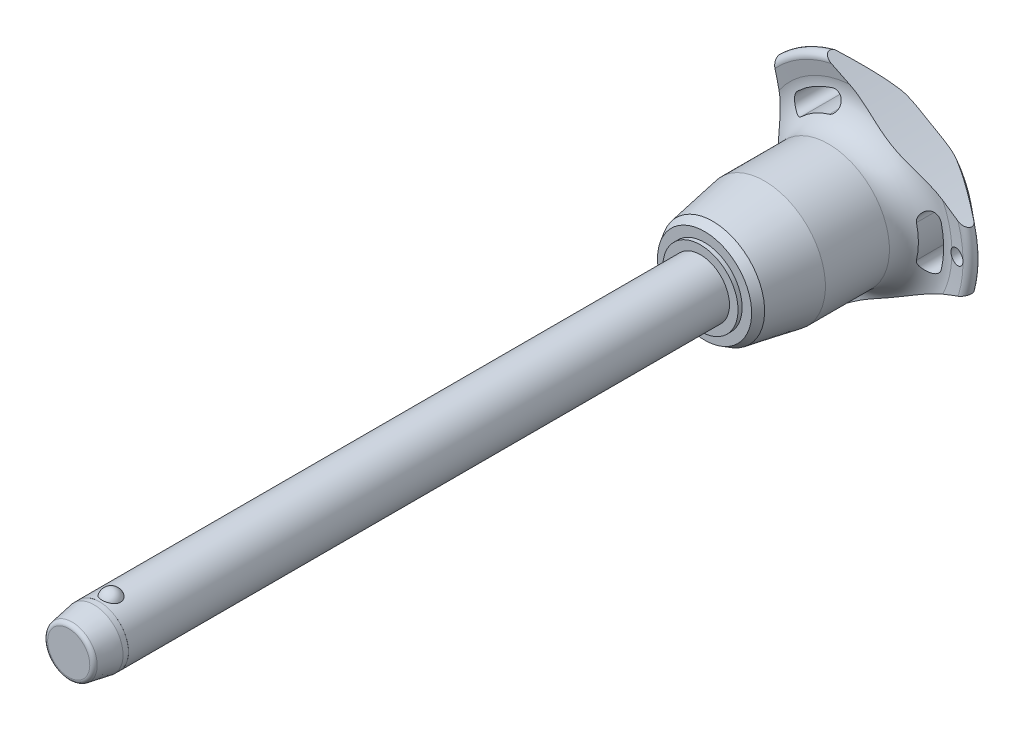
from build123d import *

# Parameters (mm, degrees)
SKETCH1_R           = 6
BOSS_EXTRUDE1_DEPTH = 120
SKETCH2_R           = 5.15
BOSS_EXTRUDE2_DEPTH = 39.7
BOSS_EXTRUDE3_START = 10.6
SKETCH1_2_R         = 6
BOSS_EXTRUDE3_DEPTH = 10.6
CHAMFER1_SIZE       = 5.3
CHAMFER1_SIZE2      = 0.934532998
FILLET1_R           = 0.85
SKETCH6_R           = 144.275
CUT_EXTRUDE1_DEPTH  = 164.211281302
CIRPATTERN1_COUNT   = 3
SKETCH7_R           = 1.5
CUT_EXTRUDE2_DEPTH  = 164.08827178
SKETCH8_R           = 6
SKETCH8_R_2         = 5.99
CUT_EXTRUDE3_DEPTH  = 6.36


with BuildPart() as part:
    # Sketch1 → Boss-Extrude1 (new body)
    with BuildSketch(Plane.XY):
        Circle(SKETCH1_R)
    extrude(amount=-BOSS_EXTRUDE1_DEPTH)

    # Sketch2 → Boss-Extrude2 (add)
    with BuildSketch(Plane(origin=(0, 0, -120), x_dir=(-1, 0, 0), z_dir=(0, 0, -1))):
        Circle(SKETCH2_R)
    extrude(amount=BOSS_EXTRUDE2_DEPTH)

    # Sketch3 → Revolve1 (revolve)
    with BuildSketch(Plane(origin=(0, 0, 0), x_dir=(0, 0, -1), z_dir=(1, 0, 0))):
        with BuildLine():
            Line((-1.854049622, 7.25), (-1.854049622, 3.25))
            ThreePointArc((-1.854049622, 3.25), (0.145950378, 5.25), (-1.854049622, 7.25))
        make_face()
        with BuildLine():
            Line((-1.854049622, -3.25), (-1.854049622, -7.25))
            ThreePointArc((-1.854049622, -7.25), (0.145950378, -5.25), (-1.854049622, -3.25))
        make_face()
    revolve(axis=Axis((0, -3.25, 1.854049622), (0, 1, 0)))

    # Sketch1_2 → Boss-Extrude3 (add)
    with BuildSketch(Plane.XY.offset(BOSS_EXTRUDE3_START)):
        Circle(SKETCH1_2_R)
    extrude(amount=-BOSS_EXTRUDE3_DEPTH)

    # Chamfer1
    chamfer1_edges = [part.edges().sort_by_distance(p)[0] for p in [
        (-6, 0, 10.6),
    ]]
    chamfer1_side = [part.faces().sort_by_distance(p)[0] for p in [
        (-6, 0, -54.7),
    ]]
    chamfer(chamfer1_edges, length=CHAMFER1_SIZE, length2=CHAMFER1_SIZE2, reference=chamfer1_side[0])

    # Fillet1
    fillet1_edges = [part.edges().sort_by_distance(p)[0] for p in [
        (-5.065467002, 0, 10.6),
        (5.15, 0, -159.7),
    ]]
    fillet(fillet1_edges, radius=FILLET1_R)

    # Sketch4 → Revolve2 (revolve)
    with BuildSketch(Plane(origin=(0, 0, 0), x_dir=(0, 0, -1), z_dir=(1, 0, 0)), mode=Mode.PRIVATE) as revolve2_sk:
        Polygon((120, 0), (120, 7.770471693), (120.85, 7.770471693), (120.85, 9.734414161), (122.550824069, 10.716385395), (133.233333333, 12.6), (146.466666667, 12.6), (146.466666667, 0), align=None)
    revolve(revolve2_sk.sketch.rotate(Axis((0, 0, -146.466666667), (0, 0, 1)), 90), axis=Axis((0, 0, -146.466666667), (0, 0, 1)))

    # Sketch5 → Revolve3 (revolve)
    with BuildSketch(Plane(origin=(0, 0, 0), x_dir=(0, 0, -1), z_dir=(1, 0, 0)), mode=Mode.PRIVATE) as revolve3_sk:
        with BuildLine():
            Line((152.379459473, 19.619255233), (151.900774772, 22.396148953))
            ThreePointArc((151.900774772, 22.396148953), (152.578274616, 23.688538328), (154.002586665, 23.371345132))
            Line((154.002586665, 23.371345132), (159.141488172, 17.247040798))
            ThreePointArc((159.141488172, 17.247040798), (159.7, 15.584758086), (158.978803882, 13.986322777))
            ThreePointArc((158.978803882, 13.986322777), (154.617427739, 7.589034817), (153.083333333, 0))
            Line((153.083333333, 0), (146.466666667, 0))
            Line((146.466666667, 0), (146.466666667, 12.6))
            ThreePointArc((146.466666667, 12.6), (151.055540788, 14.734481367), (152.379459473, 19.619255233))
        make_face()
    revolve(revolve3_sk.sketch.rotate(Axis((0, 0, -153.083333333), (0, 0, 1)), 90), axis=Axis((0, 0, -153.083333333), (0, 0, 1)))

    # Sketch6 → Cut-Extrude1 (cut, through all)
    with BuildSketch(Plane.XY):
        with Locations((-159.975, 0)):
            Circle(SKETCH6_R)
        with BuildLine():
            ThreePointArc((17.365443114, -4.192809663), (17.864441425, 0), (17.365443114, 4.192809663))
            ThreePointArc((17.365443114, 4.192809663), (15.247788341, 5.486749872), (13.953848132, 3.369095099))
            ThreePointArc((13.953848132, 3.369095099), (14.354813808, 0), (13.953848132, -3.369095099))
            ThreePointArc((13.953848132, -3.369095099), (15.247788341, -5.486749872), (17.365443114, -4.192809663))
        make_face()
    cut_extrude1 = extrude(amount=-CUT_EXTRUDE1_DEPTH, mode=Mode.SUBTRACT)

    # CirPattern1: Cut-Extrude1 ×3 about axis
    cirpattern1_axis = Axis((0, 0, 0), (0, 0, 1))
    for i in range(1, CIRPATTERN1_COUNT):
        add(cut_extrude1.rotate(cirpattern1_axis, i * 360 / CIRPATTERN1_COUNT), mode=Mode.SUBTRACT)

    # Sketch7 → Cut-Extrude2 (cut, through all)
    with BuildSketch(Plane.XY):
        with Locations(Location((20.864441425, 0, 0), (0, 0, 221.008319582))):
            Circle(SKETCH7_R)
    extrude(amount=-CUT_EXTRUDE2_DEPTH, mode=Mode.SUBTRACT)

    # Sketch8 → Cut-Extrude3 (cut)
    with BuildSketch(Plane.XY.offset(10.6)):
        Circle(SKETCH8_R)
        Circle(SKETCH8_R_2, mode=Mode.SUBTRACT)
    extrude(amount=-CUT_EXTRUDE3_DEPTH, mode=Mode.SUBTRACT)


solid = part.part
